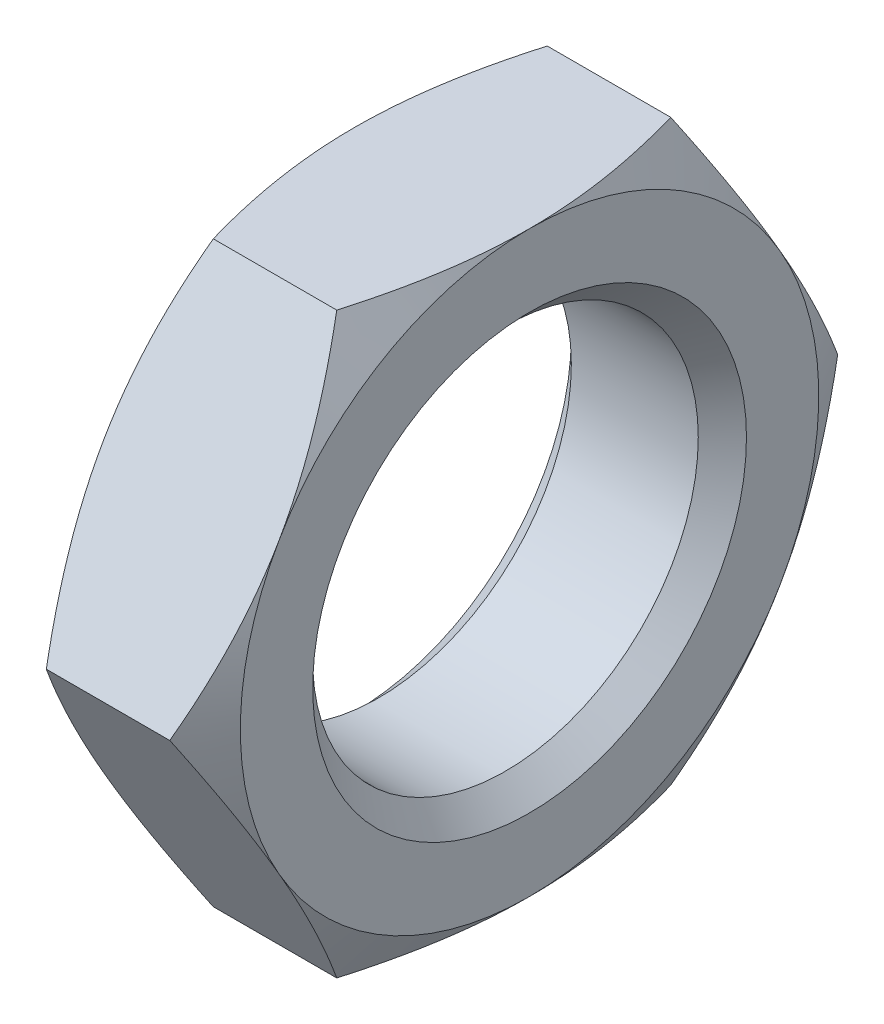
from build123d import *

# Parameters (mm, degrees)
SKETCH1_R      = 12
EXTRUDE1_DEPTH = 10.9
CHAMFER1_SIZE  = 1.5


with BuildPart() as part:
    # Sketch1 → Extrude1 (new body)
    with BuildSketch(Plane(origin=(0, 0, 0), x_dir=(0, 0, -1), z_dir=(1, 0, 0))):
        Polygon((10.392304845, 18), (-10.392304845, 18), (-20.784609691, 0), (-10.392304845, -18), (10.392304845, -18), (20.784609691, 0), align=None)
        Circle(SKETCH1_R, mode=Mode.SUBTRACT)
    extrude(amount=EXTRUDE1_DEPTH)

    # Sketch2 → Cut-Revolve1 (revolve, cut)
    with BuildSketch(Plane.XY):
        Polygon((10.9, 18), (10.9, 72), (0, 72), (0, 18), (5.45, 27.439676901), align=None)
    revolve(axis=Axis((10.9, 0, 0), (-1, 0, 0)), mode=Mode.SUBTRACT)

    # Chamfer1
    chamfer1_edges = [part.edges().sort_by_distance(p)[0] for p in [
        (0, 0, 12),
        (10.9, 0, 12),
    ]]
    chamfer(chamfer1_edges, length=CHAMFER1_SIZE)


solid = part.part
